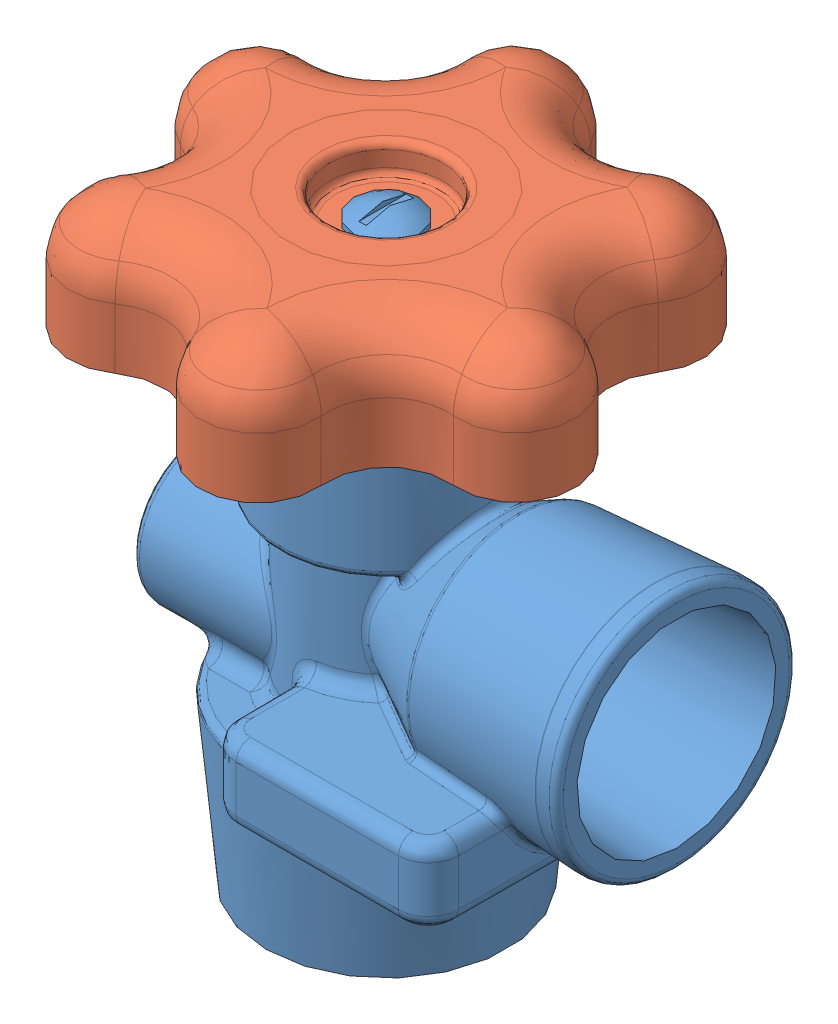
SolidWorks assembly Propane Valve Assembly.SLDASM, configuration Default (file format 10000). Lengths in mm.
Overall size (59.33 63.7 60.99).
2 component instances, 2 part files, 0 mates.
Components (placement in the parent):
- Valve Body-1: Valve Body.SLDPRT [Default] at (0 346.6331 0) x (-1 0 0) z (0 0 -1) size (49.7 61.89 38.1)
- Knob, Gas Valve-1: Knob, Gas Valve.SLDPRT [Default] at (0 409.9731 0) x (-0.96497 0 0.262361) z (0 -1 0) size (45.62 50.8 13.06)
